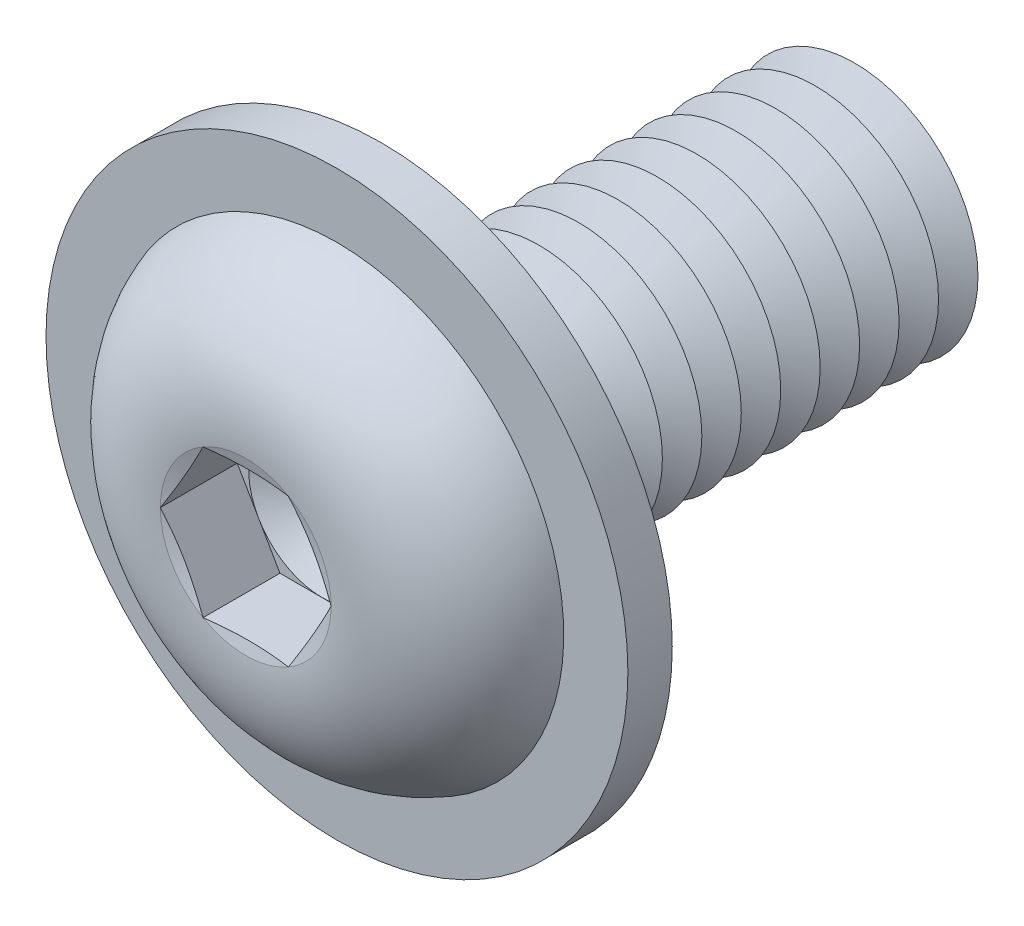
ISO-10303-21;
HEADER;
FILE_DESCRIPTION(('STEP AP214'),'2;1');
FILE_NAME('part.step','',(''),(''),'','','');
FILE_SCHEMA(('AUTOMOTIVE_DESIGN { 1 0 10303 214 1 1 1 1 }'));
ENDSEC;
DATA;
#1=APPLICATION_CONTEXT('core data for automotive mechanical design processes');
#2=APPLICATION_PROTOCOL_DEFINITION('international standard','automotive_design',2000,#1);
#3=PRODUCT_CONTEXT('',#1,'mechanical');
#4=PRODUCT('Part','Part','',(#3));
#5=PRODUCT_RELATED_PRODUCT_CATEGORY('part','',(#4));
#6=PRODUCT_DEFINITION_FORMATION('','',#4);
#7=PRODUCT_DEFINITION_CONTEXT('part definition',#1,'design');
#8=PRODUCT_DEFINITION('design','',#6,#7);
#9=PRODUCT_DEFINITION_SHAPE('','',#8);
#10=(LENGTH_UNIT() NAMED_UNIT(*) SI_UNIT(.MILLI.,.METRE.));
#11=(NAMED_UNIT(*) PLANE_ANGLE_UNIT() SI_UNIT($,.RADIAN.));
#12=(NAMED_UNIT(*) SI_UNIT($,.STERADIAN.) SOLID_ANGLE_UNIT());
#13=UNCERTAINTY_MEASURE_WITH_UNIT(LENGTH_MEASURE(1.E-05),#10,'distance_accuracy_value','');
#14=(GEOMETRIC_REPRESENTATION_CONTEXT(3) GLOBAL_UNCERTAINTY_ASSIGNED_CONTEXT((#13)) GLOBAL_UNIT_ASSIGNED_CONTEXT((#10,
#11,#12)) REPRESENTATION_CONTEXT('',''));
#15=CARTESIAN_POINT('',(0.,0.,0.));
#16=DIRECTION('',(0.,0.,1.));
#17=DIRECTION('',(1.,0.,0.));
#18=AXIS2_PLACEMENT_3D('',#15,#16,#17);
#19=CARTESIAN_POINT('',(0.,0.,-7.2));
#20=DIRECTION('',(0.,0.,1.));
#21=DIRECTION('',(1.,0.,0.));
#22=AXIS2_PLACEMENT_3D('',#19,#20,#21);
#23=CONICAL_SURFACE('',#22,2.50000000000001,1.0471975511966);
#24=CARTESIAN_POINT('',(0.,0.,-7.6));
#25=DIRECTION('',(0.,0.,1.));
#26=DIRECTION('',(1.,0.,0.));
#27=AXIS2_PLACEMENT_3D('',#24,#25,#26);
#28=CIRCLE('',#27,1.80717967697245);
#29=CARTESIAN_POINT('',(1.80717967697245,0.,-7.6));
#30=VERTEX_POINT('',#29);
#31=EDGE_CURVE('E305',#30,#30,#28,.T.);
#32=ORIENTED_EDGE('',*,*,#31,.T.);
#33=EDGE_LOOP('',(#32));
#34=FACE_BOUND('',#33,.T.);
#35=CARTESIAN_POINT('',(0.,0.,-7.2));
#36=DIRECTION('',(0.,0.,1.));
#37=DIRECTION('',(1.,0.,0.));
#38=AXIS2_PLACEMENT_3D('',#35,#36,#37);
#39=CIRCLE('',#38,2.50000000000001);
#40=CARTESIAN_POINT('',(2.50000000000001,0.,-7.2));
#41=VERTEX_POINT('',#40);
#42=EDGE_CURVE('E301',#41,#41,#39,.T.);
#43=ORIENTED_EDGE('',*,*,#42,.F.);
#44=EDGE_LOOP('',(#43));
#45=FACE_BOUND('',#44,.T.);
#46=ADVANCED_FACE('F39',(#34,#45),#23,.T.);
#47=CARTESIAN_POINT('',(0.,0.,-7.6));
#48=DIRECTION('',(0.,0.,-1.));
#49=DIRECTION('',(-1.,0.,0.));
#50=AXIS2_PLACEMENT_3D('',#47,#48,#49);
#51=CONICAL_SURFACE('',#50,1.80717967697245,1.0471975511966);
#52=CARTESIAN_POINT('',(0.,0.,-8.));
#53=DIRECTION('',(0.,0.,1.));
#54=DIRECTION('',(1.,0.,0.));
#55=AXIS2_PLACEMENT_3D('',#52,#53,#54);
#56=CIRCLE('',#55,2.50000000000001);
#57=CARTESIAN_POINT('',(2.50000000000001,0.,-8.));
#58=VERTEX_POINT('',#57);
#59=EDGE_CURVE('E309',#58,#58,#56,.T.);
#60=ORIENTED_EDGE('',*,*,#59,.T.);
#61=EDGE_LOOP('',(#60));
#62=FACE_BOUND('',#61,.T.);
#63=ORIENTED_EDGE('',*,*,#31,.F.);
#64=EDGE_LOOP('',(#63));
#65=FACE_BOUND('',#64,.T.);
#66=ADVANCED_FACE('F435',(#62,#65),#51,.T.);
#67=CARTESIAN_POINT('',(0.,2.50000000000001,-10.));
#68=DIRECTION('',(0.,0.,-1.));
#69=DIRECTION('',(-1.,0.,0.));
#70=AXIS2_PLACEMENT_3D('',#67,#68,#69);
#71=PLANE('',#70);
#72=CARTESIAN_POINT('',(0.,0.,-10.));
#73=DIRECTION('',(0.,0.,1.));
#74=DIRECTION('',(1.,0.,0.));
#75=AXIS2_PLACEMENT_3D('',#72,#73,#74);
#76=CIRCLE('',#75,1.80717967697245);
#77=CARTESIAN_POINT('',(1.80717967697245,0.,-10.));
#78=VERTEX_POINT('',#77);
#79=EDGE_CURVE('E329',#78,#78,#76,.T.);
#80=ORIENTED_EDGE('',*,*,#79,.F.);
#81=EDGE_LOOP('',(#80));
#82=FACE_BOUND('',#81,.T.);
#83=ADVANCED_FACE('F441',(#82),#71,.T.);
#84=CARTESIAN_POINT('',(0.,0.,-9.6));
#85=DIRECTION('',(0.,0.,1.));
#86=DIRECTION('',(1.,0.,0.));
#87=AXIS2_PLACEMENT_3D('',#84,#85,#86);
#88=CONICAL_SURFACE('',#87,2.50000000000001,1.0471975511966);
#89=ORIENTED_EDGE('',*,*,#79,.T.);
#90=EDGE_LOOP('',(#89));
#91=FACE_BOUND('',#90,.T.);
#92=CARTESIAN_POINT('',(0.,0.,-9.6));
#93=DIRECTION('',(0.,0.,1.));
#94=DIRECTION('',(1.,0.,0.));
#95=AXIS2_PLACEMENT_3D('',#92,#93,#94);
#96=CIRCLE('',#95,2.50000000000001);
#97=CARTESIAN_POINT('',(2.50000000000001,0.,-9.6));
#98=VERTEX_POINT('',#97);
#99=EDGE_CURVE('E325',#98,#98,#96,.T.);
#100=ORIENTED_EDGE('',*,*,#99,.F.);
#101=EDGE_LOOP('',(#100));
#102=FACE_BOUND('',#101,.T.);
#103=ADVANCED_FACE('F460',(#91,#102),#88,.T.);
#104=CARTESIAN_POINT('',(0.,0.,-9.2));
#105=DIRECTION('',(0.,0.,-1.));
#106=DIRECTION('',(-1.,0.,0.));
#107=AXIS2_PLACEMENT_3D('',#104,#105,#106);
#108=CONICAL_SURFACE('',#107,1.80717967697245,1.0471975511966);
#109=ORIENTED_EDGE('',*,*,#99,.T.);
#110=EDGE_LOOP('',(#109));
#111=FACE_BOUND('',#110,.T.);
#112=CARTESIAN_POINT('',(0.,0.,-9.2));
#113=DIRECTION('',(0.,0.,1.));
#114=DIRECTION('',(1.,0.,0.));
#115=AXIS2_PLACEMENT_3D('',#112,#113,#114);
#116=CIRCLE('',#115,1.80717967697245);
#117=CARTESIAN_POINT('',(1.80717967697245,0.,-9.2));
#118=VERTEX_POINT('',#117);
#119=EDGE_CURVE('E321',#118,#118,#116,.T.);
#120=ORIENTED_EDGE('',*,*,#119,.F.);
#121=EDGE_LOOP('',(#120));
#122=FACE_BOUND('',#121,.T.);
#123=ADVANCED_FACE('F457',(#111,#122),#108,.T.);
#124=CARTESIAN_POINT('',(0.,0.,-8.8));
#125=DIRECTION('',(0.,0.,1.));
#126=DIRECTION('',(1.,0.,0.));
#127=AXIS2_PLACEMENT_3D('',#124,#125,#126);
#128=CONICAL_SURFACE('',#127,2.50000000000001,1.0471975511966);
#129=ORIENTED_EDGE('',*,*,#119,.T.);
#130=EDGE_LOOP('',(#129));
#131=FACE_BOUND('',#130,.T.);
#132=CARTESIAN_POINT('',(0.,0.,-8.8));
#133=DIRECTION('',(0.,0.,1.));
#134=DIRECTION('',(1.,0.,0.));
#135=AXIS2_PLACEMENT_3D('',#132,#133,#134);
#136=CIRCLE('',#135,2.50000000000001);
#137=CARTESIAN_POINT('',(2.50000000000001,0.,-8.8));
#138=VERTEX_POINT('',#137);
#139=EDGE_CURVE('E317',#138,#138,#136,.T.);
#140=ORIENTED_EDGE('',*,*,#139,.F.);
#141=EDGE_LOOP('',(#140));
#142=FACE_BOUND('',#141,.T.);
#143=ADVANCED_FACE('F451',(#131,#142),#128,.T.);
#144=CARTESIAN_POINT('',(0.,0.,-8.4));
#145=DIRECTION('',(0.,0.,-1.));
#146=DIRECTION('',(-1.,0.,0.));
#147=AXIS2_PLACEMENT_3D('',#144,#145,#146);
#148=CONICAL_SURFACE('',#147,1.80717967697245,1.0471975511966);
#149=ORIENTED_EDGE('',*,*,#139,.T.);
#150=EDGE_LOOP('',(#149));
#151=FACE_BOUND('',#150,.T.);
#152=CARTESIAN_POINT('',(0.,0.,-8.4));
#153=DIRECTION('',(0.,0.,1.));
#154=DIRECTION('',(1.,0.,0.));
#155=AXIS2_PLACEMENT_3D('',#152,#153,#154);
#156=CIRCLE('',#155,1.80717967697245);
#157=CARTESIAN_POINT('',(1.80717967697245,0.,-8.4));
#158=VERTEX_POINT('',#157);
#159=EDGE_CURVE('E313',#158,#158,#156,.T.);
#160=ORIENTED_EDGE('',*,*,#159,.F.);
#161=EDGE_LOOP('',(#160));
#162=FACE_BOUND('',#161,.T.);
#163=ADVANCED_FACE('F447',(#151,#162),#148,.T.);
#164=CARTESIAN_POINT('',(0.,0.,-8.));
#165=DIRECTION('',(0.,0.,1.));
#166=DIRECTION('',(1.,0.,0.));
#167=AXIS2_PLACEMENT_3D('',#164,#165,#166);
#168=CONICAL_SURFACE('',#167,2.50000000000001,1.0471975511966);
#169=ORIENTED_EDGE('',*,*,#159,.T.);
#170=EDGE_LOOP('',(#169));
#171=FACE_BOUND('',#170,.T.);
#172=ORIENTED_EDGE('',*,*,#59,.F.);
#173=EDGE_LOOP('',(#172));
#174=FACE_BOUND('',#173,.T.);
#175=ADVANCED_FACE('F450',(#171,#174),#168,.T.);
#176=CARTESIAN_POINT('',(0.,0.,-6.4));
#177=DIRECTION('',(0.,0.,1.));
#178=DIRECTION('',(1.,0.,0.));
#179=AXIS2_PLACEMENT_3D('',#176,#177,#178);
#180=CONICAL_SURFACE('',#179,2.50000000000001,1.0471975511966);
#181=CARTESIAN_POINT('',(0.,0.,-6.8));
#182=DIRECTION('',(0.,0.,1.));
#183=DIRECTION('',(1.,0.,0.));
#184=AXIS2_PLACEMENT_3D('',#181,#182,#183);
#185=CIRCLE('',#184,1.80717967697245);
#186=CARTESIAN_POINT('',(1.80717967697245,0.,-6.8));
#187=VERTEX_POINT('',#186);
#188=EDGE_CURVE('E297',#187,#187,#185,.T.);
#189=ORIENTED_EDGE('',*,*,#188,.T.);
#190=EDGE_LOOP('',(#189));
#191=FACE_BOUND('',#190,.T.);
#192=CARTESIAN_POINT('',(0.,0.,-6.4));
#193=DIRECTION('',(0.,0.,1.));
#194=DIRECTION('',(1.,0.,0.));
#195=AXIS2_PLACEMENT_3D('',#192,#193,#194);
#196=CIRCLE('',#195,2.50000000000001);
#197=CARTESIAN_POINT('',(2.50000000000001,0.,-6.4));
#198=VERTEX_POINT('',#197);
#199=EDGE_CURVE('E293',#198,#198,#196,.T.);
#200=ORIENTED_EDGE('',*,*,#199,.F.);
#201=EDGE_LOOP('',(#200));
#202=FACE_BOUND('',#201,.T.);
#203=ADVANCED_FACE('F455',(#191,#202),#180,.T.);
#204=CARTESIAN_POINT('',(0.,0.,-6.8));
#205=DIRECTION('',(0.,0.,-1.));
#206=DIRECTION('',(-1.,0.,0.));
#207=AXIS2_PLACEMENT_3D('',#204,#205,#206);
#208=CONICAL_SURFACE('',#207,1.80717967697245,1.0471975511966);
#209=ORIENTED_EDGE('',*,*,#42,.T.);
#210=EDGE_LOOP('',(#209));
#211=FACE_BOUND('',#210,.T.);
#212=ORIENTED_EDGE('',*,*,#188,.F.);
#213=EDGE_LOOP('',(#212));
#214=FACE_BOUND('',#213,.T.);
#215=ADVANCED_FACE('F506',(#211,#214),#208,.T.);
#216=CARTESIAN_POINT('',(0.,0.,-5.6));
#217=DIRECTION('',(0.,0.,1.));
#218=DIRECTION('',(1.,0.,0.));
#219=AXIS2_PLACEMENT_3D('',#216,#217,#218);
#220=CONICAL_SURFACE('',#219,2.50000000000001,1.0471975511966);
#221=CARTESIAN_POINT('',(0.,0.,-6.));
#222=DIRECTION('',(0.,0.,1.));
#223=DIRECTION('',(1.,0.,0.));
#224=AXIS2_PLACEMENT_3D('',#221,#222,#223);
#225=CIRCLE('',#224,1.80717967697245);
#226=CARTESIAN_POINT('',(1.80717967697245,0.,-6.));
#227=VERTEX_POINT('',#226);
#228=EDGE_CURVE('E289',#227,#227,#225,.T.);
#229=ORIENTED_EDGE('',*,*,#228,.T.);
#230=EDGE_LOOP('',(#229));
#231=FACE_BOUND('',#230,.T.);
#232=CARTESIAN_POINT('',(0.,0.,-5.6));
#233=DIRECTION('',(0.,0.,1.));
#234=DIRECTION('',(1.,0.,0.));
#235=AXIS2_PLACEMENT_3D('',#232,#233,#234);
#236=CIRCLE('',#235,2.50000000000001);
#237=CARTESIAN_POINT('',(2.50000000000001,0.,-5.6));
#238=VERTEX_POINT('',#237);
#239=EDGE_CURVE('E285',#238,#238,#236,.T.);
#240=ORIENTED_EDGE('',*,*,#239,.F.);
#241=EDGE_LOOP('',(#240));
#242=FACE_BOUND('',#241,.T.);
#243=ADVANCED_FACE('F512',(#231,#242),#220,.T.);
#244=CARTESIAN_POINT('',(0.,0.,-6.));
#245=DIRECTION('',(0.,0.,-1.));
#246=DIRECTION('',(-1.,0.,0.));
#247=AXIS2_PLACEMENT_3D('',#244,#245,#246);
#248=CONICAL_SURFACE('',#247,1.80717967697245,1.0471975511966);
#249=ORIENTED_EDGE('',*,*,#199,.T.);
#250=EDGE_LOOP('',(#249));
#251=FACE_BOUND('',#250,.T.);
#252=ORIENTED_EDGE('',*,*,#228,.F.);
#253=EDGE_LOOP('',(#252));
#254=FACE_BOUND('',#253,.T.);
#255=ADVANCED_FACE('F519',(#251,#254),#248,.T.);
#256=CARTESIAN_POINT('',(0.,0.,-4.8));
#257=DIRECTION('',(0.,0.,1.));
#258=DIRECTION('',(1.,0.,0.));
#259=AXIS2_PLACEMENT_3D('',#256,#257,#258);
#260=CONICAL_SURFACE('',#259,2.50000000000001,1.0471975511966);
#261=CARTESIAN_POINT('',(0.,0.,-5.2));
#262=DIRECTION('',(0.,0.,1.));
#263=DIRECTION('',(1.,0.,0.));
#264=AXIS2_PLACEMENT_3D('',#261,#262,#263);
#265=CIRCLE('',#264,1.80717967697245);
#266=CARTESIAN_POINT('',(1.80717967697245,0.,-5.2));
#267=VERTEX_POINT('',#266);
#268=EDGE_CURVE('E281',#267,#267,#265,.T.);
#269=ORIENTED_EDGE('',*,*,#268,.T.);
#270=EDGE_LOOP('',(#269));
#271=FACE_BOUND('',#270,.T.);
#272=CARTESIAN_POINT('',(0.,0.,-4.8));
#273=DIRECTION('',(0.,0.,1.));
#274=DIRECTION('',(1.,0.,0.));
#275=AXIS2_PLACEMENT_3D('',#272,#273,#274);
#276=CIRCLE('',#275,2.50000000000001);
#277=CARTESIAN_POINT('',(2.50000000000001,0.,-4.8));
#278=VERTEX_POINT('',#277);
#279=EDGE_CURVE('E277',#278,#278,#276,.T.);
#280=ORIENTED_EDGE('',*,*,#279,.F.);
#281=EDGE_LOOP('',(#280));
#282=FACE_BOUND('',#281,.T.);
#283=ADVANCED_FACE('F526',(#271,#282),#260,.T.);
#284=CARTESIAN_POINT('',(0.,0.,-5.2));
#285=DIRECTION('',(0.,0.,-1.));
#286=DIRECTION('',(-1.,0.,0.));
#287=AXIS2_PLACEMENT_3D('',#284,#285,#286);
#288=CONICAL_SURFACE('',#287,1.80717967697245,1.0471975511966);
#289=ORIENTED_EDGE('',*,*,#239,.T.);
#290=EDGE_LOOP('',(#289));
#291=FACE_BOUND('',#290,.T.);
#292=ORIENTED_EDGE('',*,*,#268,.F.);
#293=EDGE_LOOP('',(#292));
#294=FACE_BOUND('',#293,.T.);
#295=ADVANCED_FACE('F533',(#291,#294),#288,.T.);
#296=CARTESIAN_POINT('',(0.,0.,-4.));
#297=DIRECTION('',(0.,0.,1.));
#298=DIRECTION('',(1.,0.,0.));
#299=AXIS2_PLACEMENT_3D('',#296,#297,#298);
#300=CONICAL_SURFACE('',#299,2.50000000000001,1.0471975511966);
#301=CARTESIAN_POINT('',(0.,0.,-4.4));
#302=DIRECTION('',(0.,0.,1.));
#303=DIRECTION('',(1.,0.,0.));
#304=AXIS2_PLACEMENT_3D('',#301,#302,#303);
#305=CIRCLE('',#304,1.80717967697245);
#306=CARTESIAN_POINT('',(1.80717967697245,0.,-4.4));
#307=VERTEX_POINT('',#306);
#308=EDGE_CURVE('E273',#307,#307,#305,.T.);
#309=ORIENTED_EDGE('',*,*,#308,.T.);
#310=EDGE_LOOP('',(#309));
#311=FACE_BOUND('',#310,.T.);
#312=CARTESIAN_POINT('',(0.,0.,-4.));
#313=DIRECTION('',(0.,0.,1.));
#314=DIRECTION('',(1.,0.,0.));
#315=AXIS2_PLACEMENT_3D('',#312,#313,#314);
#316=CIRCLE('',#315,2.50000000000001);
#317=CARTESIAN_POINT('',(2.50000000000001,0.,-4.));
#318=VERTEX_POINT('',#317);
#319=EDGE_CURVE('E269',#318,#318,#316,.T.);
#320=ORIENTED_EDGE('',*,*,#319,.F.);
#321=EDGE_LOOP('',(#320));
#322=FACE_BOUND('',#321,.T.);
#323=ADVANCED_FACE('F540',(#311,#322),#300,.T.);
#324=CARTESIAN_POINT('',(0.,0.,-4.4));
#325=DIRECTION('',(0.,0.,-1.));
#326=DIRECTION('',(-1.,0.,0.));
#327=AXIS2_PLACEMENT_3D('',#324,#325,#326);
#328=CONICAL_SURFACE('',#327,1.80717967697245,1.0471975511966);
#329=ORIENTED_EDGE('',*,*,#279,.T.);
#330=EDGE_LOOP('',(#329));
#331=FACE_BOUND('',#330,.T.);
#332=ORIENTED_EDGE('',*,*,#308,.F.);
#333=EDGE_LOOP('',(#332));
#334=FACE_BOUND('',#333,.T.);
#335=ADVANCED_FACE('F547',(#331,#334),#328,.T.);
#336=CARTESIAN_POINT('',(0.,0.,-3.2));
#337=DIRECTION('',(0.,0.,1.));
#338=DIRECTION('',(1.,0.,0.));
#339=AXIS2_PLACEMENT_3D('',#336,#337,#338);
#340=CONICAL_SURFACE('',#339,2.50000000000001,1.0471975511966);
#341=CARTESIAN_POINT('',(0.,0.,-3.6));
#342=DIRECTION('',(0.,0.,1.));
#343=DIRECTION('',(1.,0.,0.));
#344=AXIS2_PLACEMENT_3D('',#341,#342,#343);
#345=CIRCLE('',#344,1.80717967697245);
#346=CARTESIAN_POINT('',(1.80717967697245,0.,-3.6));
#347=VERTEX_POINT('',#346);
#348=EDGE_CURVE('E265',#347,#347,#345,.T.);
#349=ORIENTED_EDGE('',*,*,#348,.T.);
#350=EDGE_LOOP('',(#349));
#351=FACE_BOUND('',#350,.T.);
#352=CARTESIAN_POINT('',(0.,0.,-3.2));
#353=DIRECTION('',(0.,0.,1.));
#354=DIRECTION('',(1.,0.,0.));
#355=AXIS2_PLACEMENT_3D('',#352,#353,#354);
#356=CIRCLE('',#355,2.50000000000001);
#357=CARTESIAN_POINT('',(2.50000000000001,0.,-3.2));
#358=VERTEX_POINT('',#357);
#359=EDGE_CURVE('E262',#358,#358,#356,.T.);
#360=ORIENTED_EDGE('',*,*,#359,.F.);
#361=EDGE_LOOP('',(#360));
#362=FACE_BOUND('',#361,.T.);
#363=ADVANCED_FACE('F554',(#351,#362),#340,.T.);
#364=CARTESIAN_POINT('',(0.,0.,-3.6));
#365=DIRECTION('',(0.,0.,-1.));
#366=DIRECTION('',(-1.,0.,0.));
#367=AXIS2_PLACEMENT_3D('',#364,#365,#366);
#368=CONICAL_SURFACE('',#367,1.80717967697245,1.0471975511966);
#369=ORIENTED_EDGE('',*,*,#319,.T.);
#370=EDGE_LOOP('',(#369));
#371=FACE_BOUND('',#370,.T.);
#372=ORIENTED_EDGE('',*,*,#348,.F.);
#373=EDGE_LOOP('',(#372));
#374=FACE_BOUND('',#373,.T.);
#375=ADVANCED_FACE('F561',(#371,#374),#368,.T.);
#376=CARTESIAN_POINT('',(0.,0.,-2.4));
#377=DIRECTION('',(0.,0.,1.));
#378=DIRECTION('',(1.,0.,0.));
#379=AXIS2_PLACEMENT_3D('',#376,#377,#378);
#380=CONICAL_SURFACE('',#379,2.50000000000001,1.0471975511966);
#381=CARTESIAN_POINT('',(0.,0.,-2.8));
#382=DIRECTION('',(0.,0.,1.));
#383=DIRECTION('',(1.,0.,0.));
#384=AXIS2_PLACEMENT_3D('',#381,#382,#383);
#385=CIRCLE('',#384,1.80717967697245);
#386=CARTESIAN_POINT('',(1.80717967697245,0.,-2.8));
#387=VERTEX_POINT('',#386);
#388=EDGE_CURVE('E258',#387,#387,#385,.T.);
#389=ORIENTED_EDGE('',*,*,#388,.T.);
#390=EDGE_LOOP('',(#389));
#391=FACE_BOUND('',#390,.T.);
#392=CARTESIAN_POINT('',(0.,0.,-2.4));
#393=DIRECTION('',(0.,0.,1.));
#394=DIRECTION('',(1.,0.,0.));
#395=AXIS2_PLACEMENT_3D('',#392,#393,#394);
#396=CIRCLE('',#395,2.50000000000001);
#397=CARTESIAN_POINT('',(2.50000000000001,0.,-2.4));
#398=VERTEX_POINT('',#397);
#399=EDGE_CURVE('E254',#398,#398,#396,.T.);
#400=ORIENTED_EDGE('',*,*,#399,.F.);
#401=EDGE_LOOP('',(#400));
#402=FACE_BOUND('',#401,.T.);
#403=ADVANCED_FACE('F568',(#391,#402),#380,.T.);
#404=CARTESIAN_POINT('',(0.,0.,-2.8));
#405=DIRECTION('',(0.,0.,-1.));
#406=DIRECTION('',(-1.,0.,0.));
#407=AXIS2_PLACEMENT_3D('',#404,#405,#406);
#408=CONICAL_SURFACE('',#407,1.80717967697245,1.0471975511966);
#409=ORIENTED_EDGE('',*,*,#359,.T.);
#410=EDGE_LOOP('',(#409));
#411=FACE_BOUND('',#410,.T.);
#412=ORIENTED_EDGE('',*,*,#388,.F.);
#413=EDGE_LOOP('',(#412));
#414=FACE_BOUND('',#413,.T.);
#415=ADVANCED_FACE('F575',(#411,#414),#408,.T.);
#416=CARTESIAN_POINT('',(0.,0.,-1.6));
#417=DIRECTION('',(0.,0.,1.));
#418=DIRECTION('',(1.,0.,0.));
#419=AXIS2_PLACEMENT_3D('',#416,#417,#418);
#420=CONICAL_SURFACE('',#419,2.50000000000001,1.0471975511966);
#421=CARTESIAN_POINT('',(0.,0.,-2.));
#422=DIRECTION('',(0.,0.,1.));
#423=DIRECTION('',(1.,0.,0.));
#424=AXIS2_PLACEMENT_3D('',#421,#422,#423);
#425=CIRCLE('',#424,1.80717967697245);
#426=CARTESIAN_POINT('',(1.80717967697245,0.,-2.));
#427=VERTEX_POINT('',#426);
#428=EDGE_CURVE('E250',#427,#427,#425,.T.);
#429=ORIENTED_EDGE('',*,*,#428,.T.);
#430=EDGE_LOOP('',(#429));
#431=FACE_BOUND('',#430,.T.);
#432=CARTESIAN_POINT('',(0.,0.,-1.6));
#433=DIRECTION('',(0.,0.,1.));
#434=DIRECTION('',(1.,0.,0.));
#435=AXIS2_PLACEMENT_3D('',#432,#433,#434);
#436=CIRCLE('',#435,2.50000000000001);
#437=CARTESIAN_POINT('',(2.50000000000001,0.,-1.6));
#438=VERTEX_POINT('',#437);
#439=EDGE_CURVE('E242',#438,#438,#436,.T.);
#440=ORIENTED_EDGE('',*,*,#439,.F.);
#441=EDGE_LOOP('',(#440));
#442=FACE_BOUND('',#441,.T.);
#443=ADVANCED_FACE('F582',(#431,#442),#420,.T.);
#444=CARTESIAN_POINT('',(0.,0.,-2.));
#445=DIRECTION('',(0.,0.,-1.));
#446=DIRECTION('',(-1.,0.,0.));
#447=AXIS2_PLACEMENT_3D('',#444,#445,#446);
#448=CONICAL_SURFACE('',#447,1.80717967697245,1.0471975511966);
#449=ORIENTED_EDGE('',*,*,#399,.T.);
#450=EDGE_LOOP('',(#449));
#451=FACE_BOUND('',#450,.T.);
#452=ORIENTED_EDGE('',*,*,#428,.F.);
#453=EDGE_LOOP('',(#452));
#454=FACE_BOUND('',#453,.T.);
#455=ADVANCED_FACE('F589',(#451,#454),#448,.T.);
#456=CARTESIAN_POINT('',(0.,0.,-0.799999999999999));
#457=DIRECTION('',(0.,0.,1.));
#458=DIRECTION('',(1.,0.,0.));
#459=AXIS2_PLACEMENT_3D('',#456,#457,#458);
#460=CONICAL_SURFACE('',#459,2.50000000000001,1.0471975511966);
#461=CARTESIAN_POINT('',(0.,0.,-1.2));
#462=DIRECTION('',(0.,0.,1.));
#463=DIRECTION('',(1.,0.,0.));
#464=AXIS2_PLACEMENT_3D('',#461,#462,#463);
#465=CIRCLE('',#464,1.80717967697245);
#466=CARTESIAN_POINT('',(1.80717967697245,0.,-1.2));
#467=VERTEX_POINT('',#466);
#468=EDGE_CURVE('E232',#467,#467,#465,.T.);
#469=ORIENTED_EDGE('',*,*,#468,.T.);
#470=EDGE_LOOP('',(#469));
#471=FACE_BOUND('',#470,.T.);
#472=CARTESIAN_POINT('',(0.,0.,-0.799999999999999));
#473=DIRECTION('',(0.,0.,1.));
#474=DIRECTION('',(1.,0.,0.));
#475=AXIS2_PLACEMENT_3D('',#472,#473,#474);
#476=CIRCLE('',#475,2.50000000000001);
#477=CARTESIAN_POINT('',(2.50000000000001,0.,-0.799999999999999));
#478=VERTEX_POINT('',#477);
#479=EDGE_CURVE('E246',#478,#478,#476,.T.);
#480=ORIENTED_EDGE('',*,*,#479,.F.);
#481=EDGE_LOOP('',(#480));
#482=FACE_BOUND('',#481,.T.);
#483=ADVANCED_FACE('F596',(#471,#482),#460,.T.);
#484=CARTESIAN_POINT('',(0.,0.,-1.2));
#485=DIRECTION('',(0.,0.,-1.));
#486=DIRECTION('',(-1.,0.,0.));
#487=AXIS2_PLACEMENT_3D('',#484,#485,#486);
#488=CONICAL_SURFACE('',#487,1.80717967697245,1.0471975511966);
#489=ORIENTED_EDGE('',*,*,#439,.T.);
#490=EDGE_LOOP('',(#489));
#491=FACE_BOUND('',#490,.T.);
#492=ORIENTED_EDGE('',*,*,#468,.F.);
#493=EDGE_LOOP('',(#492));
#494=FACE_BOUND('',#493,.T.);
#495=ADVANCED_FACE('F221',(#491,#494),#488,.T.);
#496=CARTESIAN_POINT('',(0.,2.5,0.));
#497=DIRECTION('',(0.,0.,-1.));
#498=DIRECTION('',(-1.,0.,0.));
#499=AXIS2_PLACEMENT_3D('',#496,#497,#498);
#500=PLANE('',#499);
#501=CARTESIAN_POINT('',(0.,0.,0.));
#502=DIRECTION('',(0.,0.,-1.));
#503=DIRECTION('',(-1.,0.,0.));
#504=AXIS2_PLACEMENT_3D('',#501,#502,#503);
#505=CIRCLE('',#504,2.9);
#506=CARTESIAN_POINT('',(-2.9,0.,0.));
#507=VERTEX_POINT('',#506);
#508=EDGE_CURVE('E343',#507,#507,#505,.F.);
#509=ORIENTED_EDGE('',*,*,#508,.T.);
#510=EDGE_LOOP('',(#509));
#511=FACE_BOUND('',#510,.T.);
#512=CARTESIAN_POINT('',(0.,0.,0.));
#513=DIRECTION('',(0.,0.,-1.));
#514=DIRECTION('',(0.,1.,0.));
#515=AXIS2_PLACEMENT_3D('',#512,#513,#514);
#516=CIRCLE('',#515,5.9);
#517=CARTESIAN_POINT('',(0.,5.9,0.));
#518=VERTEX_POINT('',#517);
#519=EDGE_CURVE('E411',#518,#518,#516,.T.);
#520=ORIENTED_EDGE('',*,*,#519,.T.);
#521=EDGE_LOOP('',(#520));
#522=FACE_BOUND('',#521,.T.);
#523=ADVANCED_FACE('F421',(#511,#522),#500,.T.);
#524=CARTESIAN_POINT('',(0.,0.,-0.399999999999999));
#525=DIRECTION('',(0.,0.,-1.));
#526=DIRECTION('',(-1.,0.,0.));
#527=AXIS2_PLACEMENT_3D('',#524,#525,#526);
#528=TOROIDAL_SURFACE('',#527,2.9,0.4);
#529=ORIENTED_EDGE('',*,*,#508,.F.);
#530=EDGE_LOOP('',(#529));
#531=FACE_BOUND('',#530,.T.);
#532=CARTESIAN_POINT('',(0.,0.,-0.399999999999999));
#533=DIRECTION('',(0.,0.,-1.));
#534=DIRECTION('',(-1.,0.,0.));
#535=AXIS2_PLACEMENT_3D('',#532,#533,#534);
#536=CIRCLE('',#535,2.5);
#537=CARTESIAN_POINT('',(-2.5,0.,-0.399999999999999));
#538=VERTEX_POINT('',#537);
#539=EDGE_CURVE('E338',#538,#538,#536,.T.);
#540=ORIENTED_EDGE('',*,*,#539,.F.);
#541=EDGE_LOOP('',(#540));
#542=FACE_BOUND('',#541,.T.);
#543=ADVANCED_FACE('F41',(#531,#542),#528,.F.);
#544=CARTESIAN_POINT('',(0.,0.,-10.));
#545=DIRECTION('',(0.,0.,-1.));
#546=DIRECTION('',(-1.,0.,0.));
#547=AXIS2_PLACEMENT_3D('',#544,#545,#546);
#548=CYLINDRICAL_SURFACE('',#547,2.5);
#549=ORIENTED_EDGE('',*,*,#539,.T.);
#550=EDGE_LOOP('',(#549));
#551=FACE_BOUND('',#550,.T.);
#552=ORIENTED_EDGE('',*,*,#479,.T.);
#553=EDGE_LOOP('',(#552));
#554=FACE_BOUND('',#553,.T.);
#555=ADVANCED_FACE('F425',(#551,#554),#548,.T.);
#556=CARTESIAN_POINT('',(0.,0.,0.9));
#557=DIRECTION('',(0.,0.,-1.));
#558=DIRECTION('',(0.,1.,0.));
#559=AXIS2_PLACEMENT_3D('',#556,#557,#558);
#560=CYLINDRICAL_SURFACE('',#559,5.9);
#561=CARTESIAN_POINT('',(0.,0.,0.9));
#562=DIRECTION('',(0.,0.,-1.));
#563=DIRECTION('',(0.,1.,0.));
#564=AXIS2_PLACEMENT_3D('',#561,#562,#563);
#565=CIRCLE('',#564,5.9);
#566=CARTESIAN_POINT('',(0.,5.9,0.9));
#567=VERTEX_POINT('',#566);
#568=EDGE_CURVE('E409',#567,#567,#565,.T.);
#569=ORIENTED_EDGE('',*,*,#568,.T.);
#570=EDGE_LOOP('',(#569));
#571=FACE_BOUND('',#570,.T.);
#572=ORIENTED_EDGE('',*,*,#519,.F.);
#573=EDGE_LOOP('',(#572));
#574=FACE_BOUND('',#573,.T.);
#575=ADVANCED_FACE('F423',(#571,#574),#560,.T.);
#576=CARTESIAN_POINT('',(0.,0.,0.9));
#577=DIRECTION('',(0.,0.,-1.));
#578=DIRECTION('',(0.,1.,0.));
#579=AXIS2_PLACEMENT_3D('',#576,#577,#578);
#580=PLANE('',#579);
#581=CARTESIAN_POINT('',(0.,0.,0.9));
#582=DIRECTION('',(0.,0.,-1.));
#583=DIRECTION('',(0.,1.,0.));
#584=AXIS2_PLACEMENT_3D('',#581,#582,#583);
#585=CIRCLE('',#584,4.59924727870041);
#586=CARTESIAN_POINT('',(0.,4.59924727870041,0.9));
#587=VERTEX_POINT('',#586);
#588=EDGE_CURVE('E43',#587,#587,#585,.F.);
#589=ORIENTED_EDGE('',*,*,#588,.F.);
#590=EDGE_LOOP('',(#589));
#591=FACE_BOUND('',#590,.T.);
#592=ORIENTED_EDGE('',*,*,#568,.F.);
#593=EDGE_LOOP('',(#592));
#594=FACE_BOUND('',#593,.T.);
#595=ADVANCED_FACE('F117',(#591,#594),#580,.F.);
#596=CARTESIAN_POINT('',(0.,0.,1.19));
#597=DIRECTION('',(0.,0.,1.));
#598=DIRECTION('',(1.,0.,0.));
#599=AXIS2_PLACEMENT_3D('',#596,#597,#598);
#600=CONICAL_SURFACE('',#599,1.49999930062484,1.0471975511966);
#601=CARTESIAN_POINT('',(0.,0.,0.323975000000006));
#602=VERTEX_POINT('',#601);
#603=VERTEX_LOOP('',#602);
#604=FACE_BOUND('',#603,.T.);
#605=CARTESIAN_POINT('',(0.,0.,1.19));
#606=DIRECTION('',(0.,0.,1.));
#607=DIRECTION('',(1.,0.,0.));
#608=AXIS2_PLACEMENT_3D('',#605,#606,#607);
#609=CIRCLE('',#608,1.49999930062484);
#610=CARTESIAN_POINT('',(1.2990375,0.749999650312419,1.19));
#611=VERTEX_POINT('',#610);
#612=CARTESIAN_POINT('',(0.,1.49999930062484,1.19));
#613=VERTEX_POINT('',#612);
#614=EDGE_CURVE('E120',#611,#613,#609,.T.);
#615=ORIENTED_EDGE('',*,*,#614,.T.);
#616=CARTESIAN_POINT('',(0.,0.,1.19));
#617=DIRECTION('',(0.,0.,1.));
#618=DIRECTION('',(1.,0.,0.));
#619=AXIS2_PLACEMENT_3D('',#616,#617,#618);
#620=CIRCLE('',#619,1.49999930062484);
#621=CARTESIAN_POINT('',(-1.2990375,0.749999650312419,1.19));
#622=VERTEX_POINT('',#621);
#623=EDGE_CURVE('E11',#613,#622,#620,.T.);
#624=ORIENTED_EDGE('',*,*,#623,.T.);
#625=CARTESIAN_POINT('',(-1.2990375,-0.749999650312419,1.19));
#626=VERTEX_POINT('',#625);
#627=EDGE_CURVE('E49',#622,#626,#620,.T.);
#628=ORIENTED_EDGE('',*,*,#627,.T.);
#629=CARTESIAN_POINT('',(0.,-1.49999930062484,1.19));
#630=VERTEX_POINT('',#629);
#631=EDGE_CURVE('E348',#626,#630,#620,.T.);
#632=ORIENTED_EDGE('',*,*,#631,.T.);
#633=CARTESIAN_POINT('',(1.2990375,-0.749999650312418,1.19));
#634=VERTEX_POINT('',#633);
#635=EDGE_CURVE('E57',#630,#634,#620,.T.);
#636=ORIENTED_EDGE('',*,*,#635,.T.);
#637=EDGE_CURVE('E50',#634,#611,#620,.T.);
#638=ORIENTED_EDGE('',*,*,#637,.T.);
#639=EDGE_LOOP('',(#615,#624,#628,#632,#636,#638));
#640=FACE_BOUND('',#639,.T.);
#641=ADVANCED_FACE('F114',(#604,#640),#600,.F.);
#642=CARTESIAN_POINT('',(0.,0.,1.19));
#643=DIRECTION('',(0.,0.,1.));
#644=DIRECTION('',(1.,0.,0.));
#645=AXIS2_PLACEMENT_3D('',#642,#643,#644);
#646=PLANE('',#645);
#647=ORIENTED_EDGE('',*,*,#631,.F.);
#648=DIRECTION('',(0.5,-0.866025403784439,0.));
#649=VECTOR('',#648,1.);
#650=CARTESIAN_POINT('',(-1.73205,0.,1.19));
#651=LINE('',#650,#649);
#652=CARTESIAN_POINT('',(-0.866025,-1.49999930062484,1.19));
#653=VERTEX_POINT('',#652);
#654=EDGE_CURVE('E154',#626,#653,#651,.T.);
#655=ORIENTED_EDGE('',*,*,#654,.T.);
#656=DIRECTION('',(1.,0.,0.));
#657=VECTOR('',#656,1.);
#658=CARTESIAN_POINT('',(-0.866025,-1.49999930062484,1.19));
#659=LINE('',#658,#657);
#660=EDGE_CURVE('E160',#653,#630,#659,.T.);
#661=ORIENTED_EDGE('',*,*,#660,.T.);
#662=EDGE_LOOP('',(#647,#655,#661));
#663=FACE_BOUND('',#662,.T.);
#664=ADVANCED_FACE('F116',(#663),#646,.T.);
#665=ORIENTED_EDGE('',*,*,#635,.F.);
#666=CARTESIAN_POINT('',(0.866024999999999,-1.49999930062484,1.19));
#667=VERTEX_POINT('',#666);
#668=EDGE_CURVE('E159',#630,#667,#659,.T.);
#669=ORIENTED_EDGE('',*,*,#668,.T.);
#670=DIRECTION('',(0.5,0.866025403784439,0.));
#671=VECTOR('',#670,1.);
#672=CARTESIAN_POINT('',(0.866024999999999,-1.49999930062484,1.19));
#673=LINE('',#672,#671);
#674=EDGE_CURVE('E165',#667,#634,#673,.T.);
#675=ORIENTED_EDGE('',*,*,#674,.T.);
#676=EDGE_LOOP('',(#665,#669,#675));
#677=FACE_BOUND('',#676,.T.);
#678=ADVANCED_FACE('F645',(#677),#646,.T.);
#679=ORIENTED_EDGE('',*,*,#637,.F.);
#680=CARTESIAN_POINT('',(1.73205,0.,1.19));
#681=VERTEX_POINT('',#680);
#682=EDGE_CURVE('E164',#634,#681,#673,.T.);
#683=ORIENTED_EDGE('',*,*,#682,.T.);
#684=DIRECTION('',(-0.5,0.866025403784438,0.));
#685=VECTOR('',#684,1.);
#686=CARTESIAN_POINT('',(1.73205,0.,1.19));
#687=LINE('',#686,#685);
#688=EDGE_CURVE('E142',#681,#611,#687,.T.);
#689=ORIENTED_EDGE('',*,*,#688,.T.);
#690=EDGE_LOOP('',(#679,#683,#689));
#691=FACE_BOUND('',#690,.T.);
#692=ADVANCED_FACE('F654',(#691),#646,.T.);
#693=ORIENTED_EDGE('',*,*,#614,.F.);
#694=CARTESIAN_POINT('',(0.866025,1.49999930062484,1.19));
#695=VERTEX_POINT('',#694);
#696=EDGE_CURVE('E127',#611,#695,#687,.T.);
#697=ORIENTED_EDGE('',*,*,#696,.T.);
#698=DIRECTION('',(-1.,0.,0.));
#699=VECTOR('',#698,1.);
#700=CARTESIAN_POINT('',(0.866025,1.49999930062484,1.19));
#701=LINE('',#700,#699);
#702=EDGE_CURVE('E138',#695,#613,#701,.T.);
#703=ORIENTED_EDGE('',*,*,#702,.T.);
#704=EDGE_LOOP('',(#693,#697,#703));
#705=FACE_BOUND('',#704,.T.);
#706=ADVANCED_FACE('F144',(#705),#646,.T.);
#707=ORIENTED_EDGE('',*,*,#623,.F.);
#708=CARTESIAN_POINT('',(-0.866025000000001,1.49999930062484,1.19));
#709=VERTEX_POINT('',#708);
#710=EDGE_CURVE('E133',#613,#709,#701,.T.);
#711=ORIENTED_EDGE('',*,*,#710,.T.);
#712=DIRECTION('',(-0.5,-0.866025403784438,0.));
#713=VECTOR('',#712,1.);
#714=CARTESIAN_POINT('',(-0.866025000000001,1.49999930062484,1.19));
#715=LINE('',#714,#713);
#716=EDGE_CURVE('E136',#709,#622,#715,.T.);
#717=ORIENTED_EDGE('',*,*,#716,.T.);
#718=EDGE_LOOP('',(#707,#711,#717));
#719=FACE_BOUND('',#718,.T.);
#720=ADVANCED_FACE('F132',(#719),#646,.T.);
#721=ORIENTED_EDGE('',*,*,#627,.F.);
#722=CARTESIAN_POINT('',(-1.73205,0.,1.19));
#723=VERTEX_POINT('',#722);
#724=EDGE_CURVE('E146',#622,#723,#715,.T.);
#725=ORIENTED_EDGE('',*,*,#724,.T.);
#726=EDGE_CURVE('E155',#723,#626,#651,.T.);
#727=ORIENTED_EDGE('',*,*,#726,.T.);
#728=EDGE_LOOP('',(#721,#725,#727));
#729=FACE_BOUND('',#728,.T.);
#730=ADVANCED_FACE('F365',(#729),#646,.T.);
#731=CARTESIAN_POINT('',(-1.73205,0.,1.19));
#732=DIRECTION('',(-0.866025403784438,-0.5,0.));
#733=DIRECTION('',(0.5,-0.866025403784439,0.));
#734=AXIS2_PLACEMENT_3D('',#731,#732,#733);
#735=PLANE('',#734);
#736=CARTESIAN_POINT('',(-1.73216547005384,0.000200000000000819,2.75003094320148));
#737=CARTESIAN_POINT('',(-1.69619207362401,-0.0621077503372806,2.74038633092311));
#738=CARTESIAN_POINT('',(-1.66015343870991,-0.124528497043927,2.73163050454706));
#739=CARTESIAN_POINT('',(-1.58794885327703,-0.249590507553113,2.71624720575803));
#740=CARTESIAN_POINT('',(-1.55178285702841,-0.312231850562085,2.70962059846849));
#741=CARTESIAN_POINT('',(-1.47954289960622,-0.437355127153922,2.69888271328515));
#742=CARTESIAN_POINT('',(-1.4434694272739,-0.499836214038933,2.69475862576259));
#743=CARTESIAN_POINT('',(-1.37127646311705,-0.624878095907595,2.68922863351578));
#744=CARTESIAN_POINT('',(-1.33515698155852,-0.687438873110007,2.68782220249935));
#745=CARTESIAN_POINT('',(-1.26291801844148,-0.812560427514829,2.68782220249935));
#746=CARTESIAN_POINT('',(-1.22679853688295,-0.875121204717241,2.68922863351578));
#747=CARTESIAN_POINT('',(-1.1546055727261,-1.0001630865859,2.69475862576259));
#748=CARTESIAN_POINT('',(-1.11853210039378,-1.06264417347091,2.69888271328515));
#749=CARTESIAN_POINT('',(-1.0462921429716,-1.18776745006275,2.70962059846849));
#750=CARTESIAN_POINT('',(-1.01012614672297,-1.25040879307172,2.71624720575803));
#751=CARTESIAN_POINT('',(-0.937921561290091,-1.37547080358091,2.73163050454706));
#752=CARTESIAN_POINT('',(-0.901882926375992,-1.43789155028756,2.74038633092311));
#753=CARTESIAN_POINT('',(-0.865909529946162,-1.50019930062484,2.75003094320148));
#754=B_SPLINE_CURVE_WITH_KNOTS('',3,(#736,#737,#738,#739,#740,#741,#742,#743,#744,#745,#746,
#747,#748,#749,#750,#751,#752,#753),.UNSPECIFIED.,.F.,.F.,(4,2,2,2,2,2,2,2,4),(0.,
0.217782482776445,0.435653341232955,0.652399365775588,0.869103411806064,1.08580745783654,
1.30255348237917,1.52042434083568,1.73820682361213),.UNSPECIFIED.);
#755=CARTESIAN_POINT('',(-1.73205,0.,2.75));
#756=VERTEX_POINT('',#755);
#757=CARTESIAN_POINT('',(-0.866025,-1.49999930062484,2.75));
#758=VERTEX_POINT('',#757);
#759=EDGE_CURVE('E370',#756,#758,#754,.T.);
#760=ORIENTED_EDGE('',*,*,#759,.T.);
#761=DIRECTION('',(0.,0.,1.));
#762=VECTOR('',#761,1.);
#763=CARTESIAN_POINT('',(-0.866025,-1.49999930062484,1.19));
#764=LINE('',#763,#762);
#765=EDGE_CURVE('E178',#653,#758,#764,.T.);
#766=ORIENTED_EDGE('',*,*,#765,.F.);
#767=ORIENTED_EDGE('',*,*,#654,.F.);
#768=ORIENTED_EDGE('',*,*,#726,.F.);
#769=DIRECTION('',(0.,0.,1.));
#770=VECTOR('',#769,1.);
#771=CARTESIAN_POINT('',(-1.73205,0.,1.19));
#772=LINE('',#771,#770);
#773=EDGE_CURVE('E182',#723,#756,#772,.T.);
#774=ORIENTED_EDGE('',*,*,#773,.T.);
#775=EDGE_LOOP('',(#760,#766,#767,#768,#774));
#776=FACE_BOUND('',#775,.T.);
#777=ADVANCED_FACE('F363',(#776),#735,.F.);
#778=CARTESIAN_POINT('',(-0.866025,-1.49999930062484,1.19));
#779=DIRECTION('',(0.,-1.,0.));
#780=DIRECTION('',(0.,0.,-1.));
#781=AXIS2_PLACEMENT_3D('',#778,#779,#780);
#782=PLANE('',#781);
#783=CARTESIAN_POINT('',(-2.61375031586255,-1.49999930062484,3.09338600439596));
#784=CARTESIAN_POINT('',(-2.48719895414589,-1.49999930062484,3.06401688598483));
#785=CARTESIAN_POINT('',(-2.36054180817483,-1.49999930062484,3.03507426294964));
#786=CARTESIAN_POINT('',(-2.10688190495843,-1.49999930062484,2.97862489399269));
#787=CARTESIAN_POINT('',(-1.97987908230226,-1.49999930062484,2.95111844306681));
#788=CARTESIAN_POINT('',(-1.72425281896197,-1.49999930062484,2.89788845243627));
#789=CARTESIAN_POINT('',(-1.59562534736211,-1.49999930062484,2.87218404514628));
#790=CARTESIAN_POINT('',(-1.33776732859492,-1.49999930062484,2.82387586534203));
#791=CARTESIAN_POINT('',(-1.20853672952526,-1.49999930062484,2.80127236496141));
#792=CARTESIAN_POINT('',(-0.952831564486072,-1.49999930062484,2.76126658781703));
#793=CARTESIAN_POINT('',(-0.826376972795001,-1.49999930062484,2.74374018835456));
#794=CARTESIAN_POINT('',(-0.572755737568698,-1.49999930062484,2.71502809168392));
#795=CARTESIAN_POINT('',(-0.445589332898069,-1.49999930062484,2.70384038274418));
#796=CARTESIAN_POINT('',(-0.191333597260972,-1.49999930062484,2.68972083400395));
#797=CARTESIAN_POINT('',(-0.0642464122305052,-1.49999930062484,2.68675270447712));
#798=CARTESIAN_POINT('',(0.189835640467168,-1.49999930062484,2.68959577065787));
#799=CARTESIAN_POINT('',(0.316830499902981,-1.49999930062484,2.69540767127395));
#800=CARTESIAN_POINT('',(0.534182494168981,-1.49999930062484,2.71190493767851));
#801=CARTESIAN_POINT('',(0.624691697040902,-1.49999930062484,2.72073513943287));
#802=CARTESIAN_POINT('',(0.805336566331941,-1.49999930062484,2.74156379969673));
#803=CARTESIAN_POINT('',(0.895472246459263,-1.49999930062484,2.75356214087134));
#804=CARTESIAN_POINT('',(1.0756572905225,-1.49999930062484,2.78006977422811));
#805=CARTESIAN_POINT('',(1.16570548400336,-1.49999930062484,2.7945868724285));
#806=CARTESIAN_POINT('',(1.3454787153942,-1.49999930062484,2.82550612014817));
#807=CARTESIAN_POINT('',(1.43520373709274,-1.49999930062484,2.8419083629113));
#808=CARTESIAN_POINT('',(1.61622412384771,-1.49999930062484,2.87648604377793));
#809=CARTESIAN_POINT('',(1.70751379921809,-1.49999930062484,2.89469103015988));
#810=CARTESIAN_POINT('',(1.88986344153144,-1.49999930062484,2.93221618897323));
#811=CARTESIAN_POINT('',(1.98092340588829,-1.49999930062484,2.95153637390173));
#812=CARTESIAN_POINT('',(2.16236354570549,-1.49999930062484,2.99091506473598));
#813=CARTESIAN_POINT('',(2.25274472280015,-1.49999930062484,3.01096897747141));
#814=CARTESIAN_POINT('',(2.43335289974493,-1.49999930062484,3.05173139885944));
#815=CARTESIAN_POINT('',(2.52357990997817,-1.49999930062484,3.07243986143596));
#816=CARTESIAN_POINT('',(2.61375031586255,-1.49999930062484,3.09338600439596));
#817=B_SPLINE_CURVE_WITH_KNOTS('',3,(#783,#784,#785,#786,#787,#788,#789,#790,#791,#792,#793,
#794,#795,#796,#797,#798,#799,#800,#801,#802,#803,#804,#805,#806,#807,#808,#809,#810,#811,#812,
#813,#814,#815,#816),.UNSPECIFIED.,.F.,.F.,(4,2,2,2,2,2,2,2,2,2,2,2,2,2,2,2,4),(0.,
0.389753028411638,0.779585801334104,1.17307326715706,1.5665952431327,1.94947555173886,
2.33223427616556,2.71330039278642,3.09439710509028,3.36715350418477,3.63989980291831,
3.91350699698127,4.18712773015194,4.4663802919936,4.74563598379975,5.02337106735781,
5.30108664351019),.UNSPECIFIED.);
#818=CARTESIAN_POINT('',(0.866024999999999,-1.49999930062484,2.75));
#819=VERTEX_POINT('',#818);
#820=EDGE_CURVE('E377',#758,#819,#817,.T.);
#821=ORIENTED_EDGE('',*,*,#820,.T.);
#822=DIRECTION('',(0.,0.,1.));
#823=VECTOR('',#822,1.);
#824=CARTESIAN_POINT('',(0.866024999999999,-1.49999930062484,1.19));
#825=LINE('',#824,#823);
#826=EDGE_CURVE('E174',#667,#819,#825,.T.);
#827=ORIENTED_EDGE('',*,*,#826,.F.);
#828=ORIENTED_EDGE('',*,*,#668,.F.);
#829=ORIENTED_EDGE('',*,*,#660,.F.);
#830=ORIENTED_EDGE('',*,*,#765,.T.);
#831=EDGE_LOOP('',(#821,#827,#828,#829,#830));
#832=FACE_BOUND('',#831,.T.);
#833=ADVANCED_FACE('F687',(#832),#782,.F.);
#834=CARTESIAN_POINT('',(0.866024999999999,-1.49999930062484,1.19));
#835=DIRECTION('',(0.866025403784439,-0.5,0.));
#836=DIRECTION('',(0.5,0.866025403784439,0.));
#837=AXIS2_PLACEMENT_3D('',#834,#835,#836);
#838=PLANE('',#837);
#839=CARTESIAN_POINT('',(0.865909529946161,-1.50019930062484,2.75003094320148));
#840=CARTESIAN_POINT('',(0.90188292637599,-1.43789155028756,2.74038633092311));
#841=CARTESIAN_POINT('',(0.93792156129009,-1.37547080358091,2.73163050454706));
#842=CARTESIAN_POINT('',(1.01012614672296,-1.25040879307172,2.71624720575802));
#843=CARTESIAN_POINT('',(1.04629214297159,-1.18776745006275,2.70962059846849));
#844=CARTESIAN_POINT('',(1.11853210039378,-1.06264417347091,2.69888271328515));
#845=CARTESIAN_POINT('',(1.1546055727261,-1.0001630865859,2.69475862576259));
#846=CARTESIAN_POINT('',(1.22679853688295,-0.87512120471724,2.68922863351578));
#847=CARTESIAN_POINT('',(1.26291801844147,-0.812560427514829,2.68782220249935));
#848=CARTESIAN_POINT('',(1.33515698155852,-0.687438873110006,2.68782220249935));
#849=CARTESIAN_POINT('',(1.37127646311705,-0.624878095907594,2.68922863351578));
#850=CARTESIAN_POINT('',(1.4434694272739,-0.499836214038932,2.69475862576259));
#851=CARTESIAN_POINT('',(1.47954289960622,-0.437355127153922,2.69888271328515));
#852=CARTESIAN_POINT('',(1.5517828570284,-0.312231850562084,2.70962059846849));
#853=CARTESIAN_POINT('',(1.58794885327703,-0.249590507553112,2.71624720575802));
#854=CARTESIAN_POINT('',(1.66015343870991,-0.124528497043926,2.73163050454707));
#855=CARTESIAN_POINT('',(1.69619207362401,-0.0621077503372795,2.74038633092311));
#856=CARTESIAN_POINT('',(1.73216547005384,0.000200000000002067,2.75003094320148));
#857=B_SPLINE_CURVE_WITH_KNOTS('',3,(#839,#840,#841,#842,#843,#844,#845,#846,#847,#848,#849,
#850,#851,#852,#853,#854,#855,#856),.UNSPECIFIED.,.F.,.F.,(4,2,2,2,2,2,2,2,4),(0.,
0.217782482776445,0.435653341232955,0.652399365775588,0.869103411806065,1.08580745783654,
1.30255348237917,1.52042434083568,1.73820682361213),.UNSPECIFIED.);
#858=CARTESIAN_POINT('',(1.73205,0.,2.75));
#859=VERTEX_POINT('',#858);
#860=EDGE_CURVE('E233',#819,#859,#857,.T.);
#861=ORIENTED_EDGE('',*,*,#860,.T.);
#862=DIRECTION('',(0.,0.,1.));
#863=VECTOR('',#862,1.);
#864=CARTESIAN_POINT('',(1.73205,0.,1.19));
#865=LINE('',#864,#863);
#866=EDGE_CURVE('E169',#681,#859,#865,.T.);
#867=ORIENTED_EDGE('',*,*,#866,.F.);
#868=ORIENTED_EDGE('',*,*,#682,.F.);
#869=ORIENTED_EDGE('',*,*,#674,.F.);
#870=ORIENTED_EDGE('',*,*,#826,.T.);
#871=EDGE_LOOP('',(#861,#867,#868,#869,#870));
#872=FACE_BOUND('',#871,.T.);
#873=ADVANCED_FACE('F219',(#872),#838,.F.);
#874=CARTESIAN_POINT('',(1.73205,0.,1.19));
#875=DIRECTION('',(0.866025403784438,0.5,0.));
#876=DIRECTION('',(-0.5,0.866025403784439,0.));
#877=AXIS2_PLACEMENT_3D('',#874,#875,#876);
#878=PLANE('',#877);
#879=CARTESIAN_POINT('',(1.73216547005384,-0.000199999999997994,2.75003094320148));
#880=CARTESIAN_POINT('',(1.69619207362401,0.0621077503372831,2.74038633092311));
#881=CARTESIAN_POINT('',(1.66015343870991,0.12452849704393,2.73163050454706));
#882=CARTESIAN_POINT('',(1.58794885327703,0.249590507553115,2.71624720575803));
#883=CARTESIAN_POINT('',(1.5517828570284,0.312231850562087,2.70962059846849));
#884=CARTESIAN_POINT('',(1.47954289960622,0.437355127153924,2.69888271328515));
#885=CARTESIAN_POINT('',(1.4434694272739,0.499836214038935,2.69475862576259));
#886=CARTESIAN_POINT('',(1.37127646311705,0.624878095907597,2.68922863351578));
#887=CARTESIAN_POINT('',(1.33515698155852,0.687438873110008,2.68782220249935));
#888=CARTESIAN_POINT('',(1.26291801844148,0.81256042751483,2.68782220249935));
#889=CARTESIAN_POINT('',(1.22679853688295,0.875121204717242,2.68922863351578));
#890=CARTESIAN_POINT('',(1.1546055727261,1.0001630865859,2.69475862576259));
#891=CARTESIAN_POINT('',(1.11853210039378,1.06264417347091,2.69888271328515));
#892=CARTESIAN_POINT('',(1.0462921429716,1.18776745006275,2.70962059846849));
#893=CARTESIAN_POINT('',(1.01012614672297,1.25040879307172,2.71624720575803));
#894=CARTESIAN_POINT('',(0.937921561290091,1.37547080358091,2.73163050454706));
#895=CARTESIAN_POINT('',(0.901882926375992,1.43789155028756,2.74038633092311));
#896=CARTESIAN_POINT('',(0.865909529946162,1.50019930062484,2.75003094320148));
#897=B_SPLINE_CURVE_WITH_KNOTS('',3,(#879,#880,#881,#882,#883,#884,#885,#886,#887,#888,#889,
#890,#891,#892,#893,#894,#895,#896),.UNSPECIFIED.,.F.,.F.,(4,2,2,2,2,2,2,2,4),(0.,
0.217782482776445,0.435653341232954,0.652399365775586,0.869103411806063,1.08580745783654,
1.30255348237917,1.52042434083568,1.73820682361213),.UNSPECIFIED.);
#898=CARTESIAN_POINT('',(0.866025,1.49999930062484,2.75));
#899=VERTEX_POINT('',#898);
#900=EDGE_CURVE('E224',#859,#899,#897,.T.);
#901=ORIENTED_EDGE('',*,*,#900,.T.);
#902=DIRECTION('',(0.,0.,1.));
#903=VECTOR('',#902,1.);
#904=CARTESIAN_POINT('',(0.866025,1.49999930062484,1.19));
#905=LINE('',#904,#903);
#906=EDGE_CURVE('E65',#695,#899,#905,.T.);
#907=ORIENTED_EDGE('',*,*,#906,.F.);
#908=ORIENTED_EDGE('',*,*,#696,.F.);
#909=ORIENTED_EDGE('',*,*,#688,.F.);
#910=ORIENTED_EDGE('',*,*,#866,.T.);
#911=EDGE_LOOP('',(#901,#907,#908,#909,#910));
#912=FACE_BOUND('',#911,.T.);
#913=ADVANCED_FACE('F213',(#912),#878,.F.);
#914=CARTESIAN_POINT('',(0.866025,1.49999930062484,1.19));
#915=DIRECTION('',(0.,1.,0.));
#916=DIRECTION('',(-1.,0.,0.));
#917=AXIS2_PLACEMENT_3D('',#914,#915,#916);
#918=PLANE('',#917);
#919=CARTESIAN_POINT('',(2.61375031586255,1.49999930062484,3.09338600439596));
#920=CARTESIAN_POINT('',(2.48719895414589,1.49999930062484,3.06401688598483));
#921=CARTESIAN_POINT('',(2.36054180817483,1.49999930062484,3.03507426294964));
#922=CARTESIAN_POINT('',(2.10688190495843,1.49999930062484,2.97862489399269));
#923=CARTESIAN_POINT('',(1.97987908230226,1.49999930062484,2.95111844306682));
#924=CARTESIAN_POINT('',(1.72425281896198,1.49999930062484,2.89788845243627));
#925=CARTESIAN_POINT('',(1.59562534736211,1.49999930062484,2.87218404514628));
#926=CARTESIAN_POINT('',(1.33776732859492,1.49999930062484,2.82387586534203));
#927=CARTESIAN_POINT('',(1.20853672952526,1.49999930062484,2.80127236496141));
#928=CARTESIAN_POINT('',(0.952831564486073,1.49999930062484,2.76126658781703));
#929=CARTESIAN_POINT('',(0.826376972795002,1.49999930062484,2.74374018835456));
#930=CARTESIAN_POINT('',(0.572755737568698,1.49999930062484,2.71502809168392));
#931=CARTESIAN_POINT('',(0.44558933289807,1.49999930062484,2.70384038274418));
#932=CARTESIAN_POINT('',(0.191333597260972,1.49999930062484,2.68972083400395));
#933=CARTESIAN_POINT('',(0.0642464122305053,1.49999930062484,2.68675270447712));
#934=CARTESIAN_POINT('',(-0.189835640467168,1.49999930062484,2.68959577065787));
#935=CARTESIAN_POINT('',(-0.316830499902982,1.49999930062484,2.69540767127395));
#936=CARTESIAN_POINT('',(-0.534182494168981,1.49999930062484,2.71190493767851));
#937=CARTESIAN_POINT('',(-0.624691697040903,1.49999930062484,2.72073513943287));
#938=CARTESIAN_POINT('',(-0.805336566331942,1.49999930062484,2.74156379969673));
#939=CARTESIAN_POINT('',(-0.895472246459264,1.49999930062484,2.75356214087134));
#940=CARTESIAN_POINT('',(-1.0756572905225,1.49999930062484,2.78006977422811));
#941=CARTESIAN_POINT('',(-1.16570548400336,1.49999930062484,2.7945868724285));
#942=CARTESIAN_POINT('',(-1.3454787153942,1.49999930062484,2.82550612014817));
#943=CARTESIAN_POINT('',(-1.43520373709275,1.49999930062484,2.8419083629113));
#944=CARTESIAN_POINT('',(-1.61622412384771,1.49999930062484,2.87648604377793));
#945=CARTESIAN_POINT('',(-1.70751379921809,1.49999930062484,2.89469103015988));
#946=CARTESIAN_POINT('',(-1.88986344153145,1.49999930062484,2.93221618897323));
#947=CARTESIAN_POINT('',(-1.98092340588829,1.49999930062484,2.95153637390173));
#948=CARTESIAN_POINT('',(-2.16236354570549,1.49999930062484,2.99091506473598));
#949=CARTESIAN_POINT('',(-2.25274472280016,1.49999930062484,3.01096897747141));
#950=CARTESIAN_POINT('',(-2.43335289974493,1.49999930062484,3.05173139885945));
#951=CARTESIAN_POINT('',(-2.52357990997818,1.49999930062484,3.07243986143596));
#952=CARTESIAN_POINT('',(-2.61375031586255,1.49999930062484,3.09338600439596));
#953=B_SPLINE_CURVE_WITH_KNOTS('',3,(#919,#920,#921,#922,#923,#924,#925,#926,#927,#928,#929,
#930,#931,#932,#933,#934,#935,#936,#937,#938,#939,#940,#941,#942,#943,#944,#945,#946,#947,#948,
#949,#950,#951,#952),.UNSPECIFIED.,.F.,.F.,(4,2,2,2,2,2,2,2,2,2,2,2,2,2,2,2,4),(0.,
0.389753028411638,0.779585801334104,1.17307326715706,1.5665952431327,1.94947555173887,
2.33223427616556,2.71330039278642,3.09439710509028,3.36715350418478,3.63989980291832,
3.91350699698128,4.18712773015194,4.46638029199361,4.74563598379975,5.02337106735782,
5.3010866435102),.UNSPECIFIED.);
#954=CARTESIAN_POINT('',(-0.866025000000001,1.49999930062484,2.75));
#955=VERTEX_POINT('',#954);
#956=EDGE_CURVE('E173',#899,#955,#953,.T.);
#957=ORIENTED_EDGE('',*,*,#956,.T.);
#958=DIRECTION('',(0.,0.,1.));
#959=VECTOR('',#958,1.);
#960=CARTESIAN_POINT('',(-0.866025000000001,1.49999930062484,1.19));
#961=LINE('',#960,#959);
#962=EDGE_CURVE('E140',#709,#955,#961,.T.);
#963=ORIENTED_EDGE('',*,*,#962,.F.);
#964=ORIENTED_EDGE('',*,*,#710,.F.);
#965=ORIENTED_EDGE('',*,*,#702,.F.);
#966=ORIENTED_EDGE('',*,*,#906,.T.);
#967=EDGE_LOOP('',(#957,#963,#964,#965,#966));
#968=FACE_BOUND('',#967,.T.);
#969=ADVANCED_FACE('F137',(#968),#918,.F.);
#970=CARTESIAN_POINT('',(-0.866025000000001,1.49999930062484,1.19));
#971=DIRECTION('',(-0.866025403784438,0.5,0.));
#972=DIRECTION('',(-0.5,-0.866025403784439,0.));
#973=AXIS2_PLACEMENT_3D('',#970,#971,#972);
#974=PLANE('',#973);
#975=CARTESIAN_POINT('',(-0.865909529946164,1.50019930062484,2.75003094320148));
#976=CARTESIAN_POINT('',(-0.901882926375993,1.43789155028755,2.74038633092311));
#977=CARTESIAN_POINT('',(-0.937921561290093,1.37547080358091,2.73163050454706));
#978=CARTESIAN_POINT('',(-1.01012614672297,1.25040879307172,2.71624720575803));
#979=CARTESIAN_POINT('',(-1.0462921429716,1.18776745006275,2.70962059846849));
#980=CARTESIAN_POINT('',(-1.11853210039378,1.06264417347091,2.69888271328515));
#981=CARTESIAN_POINT('',(-1.1546055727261,1.0001630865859,2.69475862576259));
#982=CARTESIAN_POINT('',(-1.22679853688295,0.875121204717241,2.68922863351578));
#983=CARTESIAN_POINT('',(-1.26291801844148,0.81256042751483,2.68782220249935));
#984=CARTESIAN_POINT('',(-1.33515698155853,0.687438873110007,2.68782220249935));
#985=CARTESIAN_POINT('',(-1.37127646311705,0.624878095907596,2.68922863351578));
#986=CARTESIAN_POINT('',(-1.4434694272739,0.499836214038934,2.69475862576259));
#987=CARTESIAN_POINT('',(-1.47954289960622,0.437355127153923,2.69888271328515));
#988=CARTESIAN_POINT('',(-1.55178285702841,0.312231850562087,2.70962059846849));
#989=CARTESIAN_POINT('',(-1.58794885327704,0.249590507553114,2.71624720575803));
#990=CARTESIAN_POINT('',(-1.66015343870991,0.124528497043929,2.73163050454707));
#991=CARTESIAN_POINT('',(-1.69619207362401,0.062107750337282,2.74038633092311));
#992=CARTESIAN_POINT('',(-1.73216547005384,-0.000199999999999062,2.75003094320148));
#993=B_SPLINE_CURVE_WITH_KNOTS('',3,(#975,#976,#977,#978,#979,#980,#981,#982,#983,#984,#985,
#986,#987,#988,#989,#990,#991,#992),.UNSPECIFIED.,.F.,.F.,(4,2,2,2,2,2,2,2,4),(0.,
0.217782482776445,0.435653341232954,0.652399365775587,0.869103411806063,1.08580745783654,
1.30255348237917,1.52042434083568,1.73820682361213),.UNSPECIFIED.);
#994=EDGE_CURVE('E198',#955,#756,#993,.T.);
#995=ORIENTED_EDGE('',*,*,#994,.T.);
#996=ORIENTED_EDGE('',*,*,#773,.F.);
#997=ORIENTED_EDGE('',*,*,#724,.F.);
#998=ORIENTED_EDGE('',*,*,#716,.F.);
#999=ORIENTED_EDGE('',*,*,#962,.T.);
#1000=EDGE_LOOP('',(#995,#996,#997,#998,#999));
#1001=FACE_BOUND('',#1000,.T.);
#1002=ADVANCED_FACE('F212',(#1001),#974,.F.);
#1003=CARTESIAN_POINT('',(0.,0.,2.75));
#1004=DIRECTION('',(0.,0.,1.));
#1005=DIRECTION('',(1.,0.,0.));
#1006=AXIS2_PLACEMENT_3D('',#1003,#1004,#1005);
#1007=CONICAL_SURFACE('',#1006,1.73205,1.30899693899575);
#1008=ORIENTED_EDGE('',*,*,#759,.F.);
#1009=CARTESIAN_POINT('',(0.,0.,2.75));
#1010=DIRECTION('',(0.,0.,-1.));
#1011=DIRECTION('',(-1.,0.,0.));
#1012=AXIS2_PLACEMENT_3D('',#1009,#1010,#1011);
#1013=CIRCLE('',#1012,1.73205);
#1014=EDGE_CURVE('E333',#758,#756,#1013,.T.);
#1015=ORIENTED_EDGE('',*,*,#1014,.F.);
#1016=EDGE_LOOP('',(#1008,#1015));
#1017=FACE_BOUND('',#1016,.T.);
#1018=ADVANCED_FACE('F374',(#1017),#1007,.F.);
#1019=ORIENTED_EDGE('',*,*,#820,.F.);
#1020=EDGE_CURVE('E385',#819,#758,#1013,.T.);
#1021=ORIENTED_EDGE('',*,*,#1020,.F.);
#1022=EDGE_LOOP('',(#1019,#1021));
#1023=FACE_BOUND('',#1022,.T.);
#1024=ADVANCED_FACE('F723',(#1023),#1007,.F.);
#1025=ORIENTED_EDGE('',*,*,#860,.F.);
#1026=EDGE_CURVE('E398',#859,#819,#1013,.T.);
#1027=ORIENTED_EDGE('',*,*,#1026,.F.);
#1028=EDGE_LOOP('',(#1025,#1027));
#1029=FACE_BOUND('',#1028,.T.);
#1030=ADVANCED_FACE('F731',(#1029),#1007,.F.);
#1031=ORIENTED_EDGE('',*,*,#900,.F.);
#1032=EDGE_CURVE('E396',#899,#859,#1013,.T.);
#1033=ORIENTED_EDGE('',*,*,#1032,.F.);
#1034=EDGE_LOOP('',(#1031,#1033));
#1035=FACE_BOUND('',#1034,.T.);
#1036=ADVANCED_FACE('F739',(#1035),#1007,.F.);
#1037=ORIENTED_EDGE('',*,*,#956,.F.);
#1038=EDGE_CURVE('E339',#955,#899,#1013,.T.);
#1039=ORIENTED_EDGE('',*,*,#1038,.F.);
#1040=EDGE_LOOP('',(#1037,#1039));
#1041=FACE_BOUND('',#1040,.T.);
#1042=ADVANCED_FACE('F205',(#1041),#1007,.F.);
#1043=ORIENTED_EDGE('',*,*,#994,.F.);
#1044=EDGE_CURVE('E334',#756,#955,#1013,.T.);
#1045=ORIENTED_EDGE('',*,*,#1044,.F.);
#1046=EDGE_LOOP('',(#1043,#1045));
#1047=FACE_BOUND('',#1046,.T.);
#1048=ADVANCED_FACE('F388',(#1047),#1007,.F.);
#1049=CARTESIAN_POINT('',(0.,0.,0.));
#1050=DIRECTION('',(0.,0.,-1.));
#1051=DIRECTION('',(-1.,0.,0.));
#1052=AXIS2_PLACEMENT_3D('',#1049,#1050,#1051);
#1053=DEGENERATE_TOROIDAL_SURFACE('',#1052,1.98810497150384,2.76189502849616,.T.);
#1054=ORIENTED_EDGE('',*,*,#1044,.T.);
#1055=ORIENTED_EDGE('',*,*,#1038,.T.);
#1056=ORIENTED_EDGE('',*,*,#1032,.T.);
#1057=ORIENTED_EDGE('',*,*,#1026,.T.);
#1058=ORIENTED_EDGE('',*,*,#1020,.T.);
#1059=ORIENTED_EDGE('',*,*,#1014,.T.);
#1060=EDGE_LOOP('',(#1054,#1055,#1056,#1057,#1058,#1059));
#1061=FACE_BOUND('',#1060,.T.);
#1062=ORIENTED_EDGE('',*,*,#588,.T.);
#1063=EDGE_LOOP('',(#1062));
#1064=FACE_BOUND('',#1063,.T.);
#1065=ADVANCED_FACE('F380',(#1061,#1064),#1053,.T.);
#1066=CLOSED_SHELL('',(#46,#66,#83,#103,#123,#143,#163,#175,#203,#215,#243,#255,#283,#295,#323,
#335,#363,#375,#403,#415,#443,#455,#483,#495,#523,#543,#555,#575,#595,#641,#664,#678,#692,#706,
#720,#730,#777,#833,#873,#913,#969,#1002,#1018,#1024,#1030,#1036,#1042,#1048,#1065));
#1067=MANIFOLD_SOLID_BREP('B2',#1066);
#1068=ADVANCED_BREP_SHAPE_REPRESENTATION('',(#18,#1067),#14);
#1069=SHAPE_DEFINITION_REPRESENTATION(#9,#1068);
ENDSEC;
END-ISO-10303-21;
